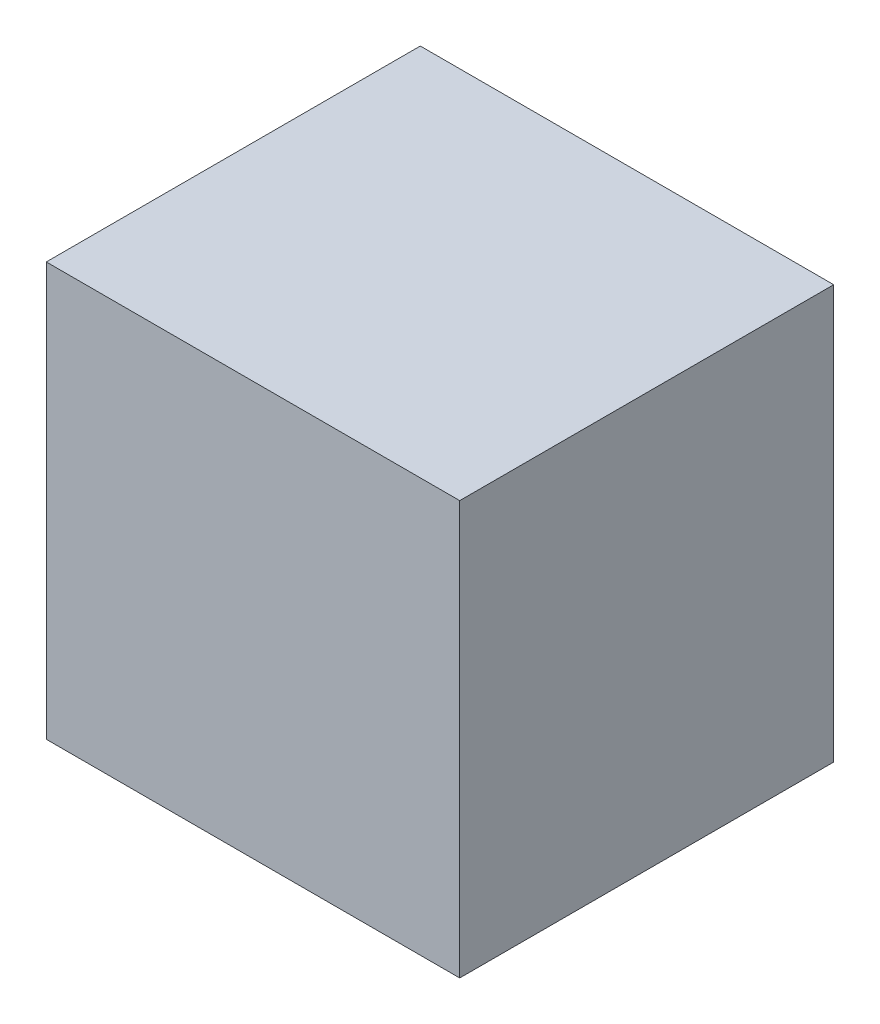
from build123d import *

# Parameters (mm, degrees)
SKETCH1_W      = 57.039491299
SKETCH1_H      = 57.039491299
EXTRUDE1_DEPTH = 25.799276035


with BuildPart() as part:
    # Sketch1 → Extrude1 (new, symmetric)
    with BuildSketch(Plane.XY):
        with Locations((28.51974565, 28.51974565)):
            Rectangle(SKETCH1_W, SKETCH1_H)
    extrude(amount=EXTRUDE1_DEPTH, both=True)


solid = part.part
